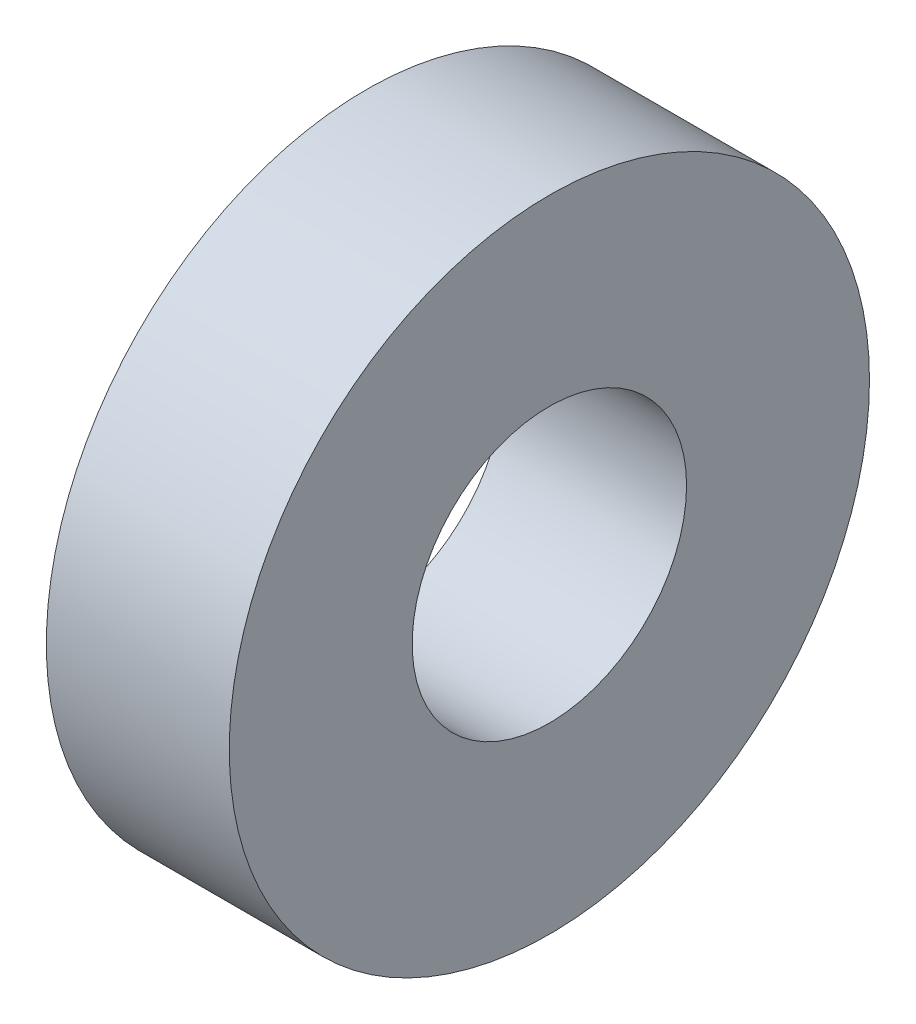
from build123d import *

# Parameters (mm, degrees)
SKETCH_1_R      = 3.5
SKETCH_1_R_2    = 1.5
EXTRUDE_1_DEPTH = 1


with BuildPart() as part:
    # Sketch 1 → Extrude 1 (new, symmetric)
    with BuildSketch(Plane(origin=(0, 0, 0), x_dir=(0, 0, -1), z_dir=(1, 0, 0))):
        Circle(SKETCH_1_R)
        Circle(SKETCH_1_R_2, mode=Mode.SUBTRACT)
    extrude(amount=EXTRUDE_1_DEPTH, both=True)


solid = part.part
